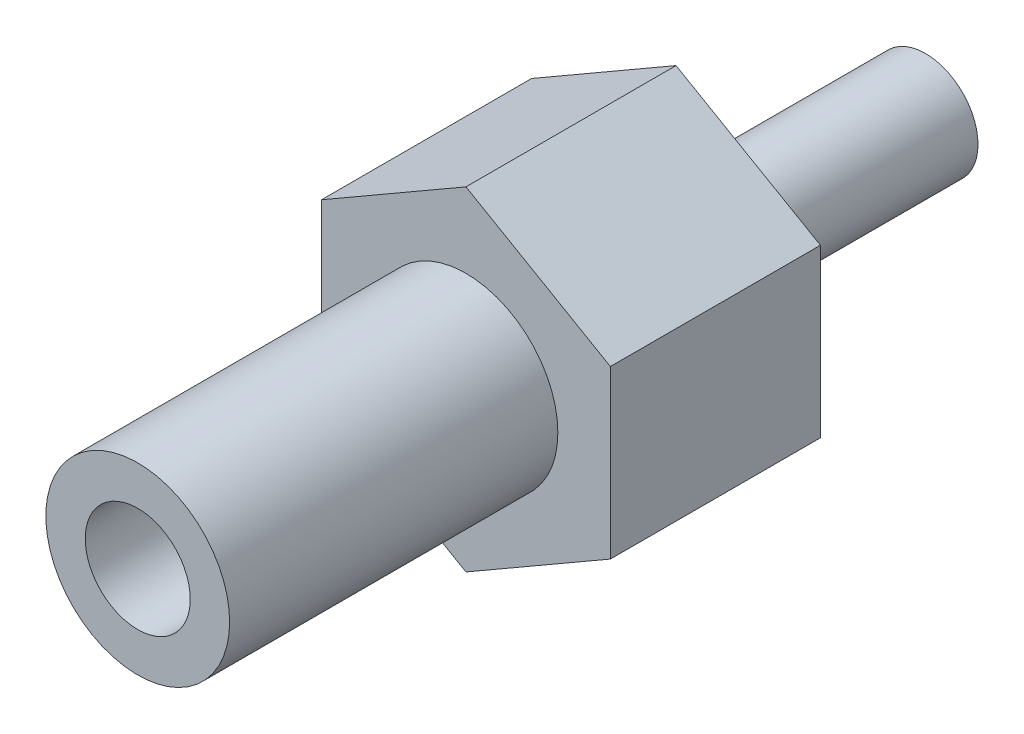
ISO-10303-21;
HEADER;
FILE_DESCRIPTION(('STEP AP214'),'2;1');
FILE_NAME('part.step','',(''),(''),'','','');
FILE_SCHEMA(('AUTOMOTIVE_DESIGN { 1 0 10303 214 1 1 1 1 }'));
ENDSEC;
DATA;
#1=APPLICATION_CONTEXT('core data for automotive mechanical design processes');
#2=APPLICATION_PROTOCOL_DEFINITION('international standard','automotive_design',2000,#1);
#3=PRODUCT_CONTEXT('',#1,'mechanical');
#4=PRODUCT('Part','Part','',(#3));
#5=PRODUCT_RELATED_PRODUCT_CATEGORY('part','',(#4));
#6=PRODUCT_DEFINITION_FORMATION('','',#4);
#7=PRODUCT_DEFINITION_CONTEXT('part definition',#1,'design');
#8=PRODUCT_DEFINITION('design','',#6,#7);
#9=PRODUCT_DEFINITION_SHAPE('','',#8);
#10=(LENGTH_UNIT() NAMED_UNIT(*) SI_UNIT(.MILLI.,.METRE.));
#11=(NAMED_UNIT(*) PLANE_ANGLE_UNIT() SI_UNIT($,.RADIAN.));
#12=(NAMED_UNIT(*) SI_UNIT($,.STERADIAN.) SOLID_ANGLE_UNIT());
#13=UNCERTAINTY_MEASURE_WITH_UNIT(LENGTH_MEASURE(1.E-05),#10,'distance_accuracy_value','');
#14=(GEOMETRIC_REPRESENTATION_CONTEXT(3) GLOBAL_UNCERTAINTY_ASSIGNED_CONTEXT((#13)) GLOBAL_UNIT_ASSIGNED_CONTEXT((#10,
#11,#12)) REPRESENTATION_CONTEXT('',''));
#15=CARTESIAN_POINT('',(0.,0.,0.));
#16=DIRECTION('',(0.,0.,1.));
#17=DIRECTION('',(1.,0.,0.));
#18=AXIS2_PLACEMENT_3D('',#15,#16,#17);
#19=CARTESIAN_POINT('',(4.,0.,17.));
#20=DIRECTION('',(0.,0.,-1.));
#21=DIRECTION('',(-1.,0.,0.));
#22=AXIS2_PLACEMENT_3D('',#19,#20,#21);
#23=PLANE('',#22);
#24=CARTESIAN_POINT('',(0.,0.,17.));
#25=DIRECTION('',(0.,0.,1.));
#26=DIRECTION('',(1.,0.,0.));
#27=AXIS2_PLACEMENT_3D('',#24,#25,#26);
#28=CIRCLE('',#27,4.);
#29=CARTESIAN_POINT('',(4.,0.,17.));
#30=VERTEX_POINT('',#29);
#31=EDGE_CURVE('E126',#30,#30,#28,.T.);
#32=ORIENTED_EDGE('',*,*,#31,.T.);
#33=EDGE_LOOP('',(#32));
#34=FACE_BOUND('',#33,.T.);
#35=ADVANCED_FACE('F14',(#34),#23,.F.);
#36=CARTESIAN_POINT('',(0.,0.,50.));
#37=DIRECTION('',(0.,0.,1.));
#38=DIRECTION('',(1.,0.,0.));
#39=AXIS2_PLACEMENT_3D('',#36,#37,#38);
#40=CYLINDRICAL_SURFACE('',#39,4.);
#41=ORIENTED_EDGE('',*,*,#31,.F.);
#42=EDGE_LOOP('',(#41));
#43=FACE_BOUND('',#42,.T.);
#44=CARTESIAN_POINT('',(0.,0.,41.));
#45=DIRECTION('',(0.,0.,1.));
#46=DIRECTION('',(1.,0.,0.));
#47=AXIS2_PLACEMENT_3D('',#44,#45,#46);
#48=CIRCLE('',#47,4.);
#49=CARTESIAN_POINT('',(4.,0.,41.));
#50=VERTEX_POINT('',#49);
#51=EDGE_CURVE('E123',#50,#50,#48,.T.);
#52=ORIENTED_EDGE('',*,*,#51,.T.);
#53=EDGE_LOOP('',(#52));
#54=FACE_BOUND('',#53,.T.);
#55=ADVANCED_FACE('F149',(#43,#54),#40,.F.);
#56=CARTESIAN_POINT('',(7.,0.,41.));
#57=DIRECTION('',(0.,0.,-1.));
#58=DIRECTION('',(-1.,0.,0.));
#59=AXIS2_PLACEMENT_3D('',#56,#57,#58);
#60=PLANE('',#59);
#61=ORIENTED_EDGE('',*,*,#51,.F.);
#62=EDGE_LOOP('',(#61));
#63=FACE_BOUND('',#62,.T.);
#64=CARTESIAN_POINT('',(0.,0.,41.));
#65=DIRECTION('',(0.,0.,1.));
#66=DIRECTION('',(1.,0.,0.));
#67=AXIS2_PLACEMENT_3D('',#64,#65,#66);
#68=CIRCLE('',#67,7.);
#69=CARTESIAN_POINT('',(7.,0.,41.));
#70=VERTEX_POINT('',#69);
#71=EDGE_CURVE('E120',#70,#70,#68,.T.);
#72=ORIENTED_EDGE('',*,*,#71,.T.);
#73=EDGE_LOOP('',(#72));
#74=FACE_BOUND('',#73,.T.);
#75=ADVANCED_FACE('F155',(#63,#74),#60,.F.);
#76=CARTESIAN_POINT('',(0.,0.,50.));
#77=DIRECTION('',(0.,0.,1.));
#78=DIRECTION('',(1.,0.,0.));
#79=AXIS2_PLACEMENT_3D('',#76,#77,#78);
#80=CYLINDRICAL_SURFACE('',#79,7.);
#81=ORIENTED_EDGE('',*,*,#71,.F.);
#82=EDGE_LOOP('',(#81));
#83=FACE_BOUND('',#82,.T.);
#84=CARTESIAN_POINT('',(0.,0.,16.));
#85=DIRECTION('',(0.,0.,1.));
#86=DIRECTION('',(1.,0.,0.));
#87=AXIS2_PLACEMENT_3D('',#84,#85,#86);
#88=CIRCLE('',#87,7.);
#89=CARTESIAN_POINT('',(7.,0.,16.));
#90=VERTEX_POINT('',#89);
#91=EDGE_CURVE('E75',#90,#90,#88,.T.);
#92=ORIENTED_EDGE('',*,*,#91,.T.);
#93=EDGE_LOOP('',(#92));
#94=FACE_BOUND('',#93,.T.);
#95=ADVANCED_FACE('F161',(#83,#94),#80,.T.);
#96=CARTESIAN_POINT('',(15.,0.,16.));
#97=DIRECTION('',(0.,0.,-1.));
#98=DIRECTION('',(-1.,0.,0.));
#99=AXIS2_PLACEMENT_3D('',#96,#97,#98);
#100=PLANE('',#99);
#101=DIRECTION('',(-0.866025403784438,0.5,0.));
#102=VECTOR('',#101,1.);
#103=CARTESIAN_POINT('',(0.,-12.7017059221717,16.));
#104=LINE('',#103,#102);
#105=CARTESIAN_POINT('',(0.,-12.7017059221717,16.));
#106=VERTEX_POINT('',#105);
#107=CARTESIAN_POINT('',(-11.,-6.35085296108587,16.));
#108=VERTEX_POINT('',#107);
#109=EDGE_CURVE('E95',#106,#108,#104,.T.);
#110=ORIENTED_EDGE('',*,*,#109,.F.);
#111=DIRECTION('',(0.866025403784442,0.5,0.));
#112=VECTOR('',#111,1.);
#113=CARTESIAN_POINT('',(0.,-12.7017059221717,16.));
#114=LINE('',#113,#112);
#115=CARTESIAN_POINT('',(11.,-6.35085296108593,16.));
#116=VERTEX_POINT('',#115);
#117=EDGE_CURVE('E37',#106,#116,#114,.T.);
#118=ORIENTED_EDGE('',*,*,#117,.T.);
#119=DIRECTION('',(0.,-1.,0.));
#120=VECTOR('',#119,1.);
#121=CARTESIAN_POINT('',(11.,6.35085296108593,16.));
#122=LINE('',#121,#120);
#123=CARTESIAN_POINT('',(11.,6.35085296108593,16.));
#124=VERTEX_POINT('',#123);
#125=EDGE_CURVE('E74',#124,#116,#122,.T.);
#126=ORIENTED_EDGE('',*,*,#125,.F.);
#127=DIRECTION('',(0.866025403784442,-0.5,0.));
#128=VECTOR('',#127,1.);
#129=CARTESIAN_POINT('',(0.,12.7017059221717,16.));
#130=LINE('',#129,#128);
#131=CARTESIAN_POINT('',(0.,12.7017059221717,16.));
#132=VERTEX_POINT('',#131);
#133=EDGE_CURVE('E104',#132,#124,#130,.T.);
#134=ORIENTED_EDGE('',*,*,#133,.F.);
#135=DIRECTION('',(-0.866025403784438,-0.5,0.));
#136=VECTOR('',#135,1.);
#137=CARTESIAN_POINT('',(0.,12.7017059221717,16.));
#138=LINE('',#137,#136);
#139=CARTESIAN_POINT('',(-11.,6.35085296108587,16.));
#140=VERTEX_POINT('',#139);
#141=EDGE_CURVE('E101',#132,#140,#138,.T.);
#142=ORIENTED_EDGE('',*,*,#141,.T.);
#143=DIRECTION('',(0.,-1.,0.));
#144=VECTOR('',#143,1.);
#145=CARTESIAN_POINT('',(-11.,6.35085296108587,16.));
#146=LINE('',#145,#144);
#147=EDGE_CURVE('E98',#140,#108,#146,.T.);
#148=ORIENTED_EDGE('',*,*,#147,.T.);
#149=EDGE_LOOP('',(#110,#118,#126,#134,#142,#148));
#150=FACE_BOUND('',#149,.T.);
#151=ORIENTED_EDGE('',*,*,#91,.F.);
#152=EDGE_LOOP('',(#151));
#153=FACE_BOUND('',#152,.T.);
#154=ADVANCED_FACE('F165',(#150,#153),#100,.F.);
#155=CARTESIAN_POINT('',(0.,-12.7017059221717,16.));
#156=DIRECTION('',(-0.5,0.866025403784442,0.));
#157=DIRECTION('',(-0.866025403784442,-0.5,0.));
#158=AXIS2_PLACEMENT_3D('',#155,#156,#157);
#159=PLANE('',#158);
#160=DIRECTION('',(0.,0.,-1.));
#161=VECTOR('',#160,1.);
#162=CARTESIAN_POINT('',(11.,-6.35085296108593,16.));
#163=LINE('',#162,#161);
#164=CARTESIAN_POINT('',(11.,-6.35085296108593,0.));
#165=VERTEX_POINT('',#164);
#166=EDGE_CURVE('E67',#116,#165,#163,.T.);
#167=ORIENTED_EDGE('',*,*,#166,.F.);
#168=ORIENTED_EDGE('',*,*,#117,.F.);
#169=DIRECTION('',(0.,0.,-1.));
#170=VECTOR('',#169,1.);
#171=CARTESIAN_POINT('',(0.,-12.7017059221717,16.));
#172=LINE('',#171,#170);
#173=CARTESIAN_POINT('',(0.,-12.7017059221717,0.));
#174=VERTEX_POINT('',#173);
#175=EDGE_CURVE('E81',#106,#174,#172,.T.);
#176=ORIENTED_EDGE('',*,*,#175,.T.);
#177=DIRECTION('',(0.866025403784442,0.5,0.));
#178=VECTOR('',#177,1.);
#179=CARTESIAN_POINT('',(0.,-12.7017059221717,0.));
#180=LINE('',#179,#178);
#181=EDGE_CURVE('E79',#174,#165,#180,.T.);
#182=ORIENTED_EDGE('',*,*,#181,.T.);
#183=EDGE_LOOP('',(#167,#168,#176,#182));
#184=FACE_BOUND('',#183,.T.);
#185=ADVANCED_FACE('F80',(#184),#159,.F.);
#186=CARTESIAN_POINT('',(11.,6.35085296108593,16.));
#187=DIRECTION('',(1.,0.,0.));
#188=DIRECTION('',(0.,0.,-1.));
#189=AXIS2_PLACEMENT_3D('',#186,#187,#188);
#190=PLANE('',#189);
#191=DIRECTION('',(0.,0.,-1.));
#192=VECTOR('',#191,1.);
#193=CARTESIAN_POINT('',(11.,6.35085296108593,16.));
#194=LINE('',#193,#192);
#195=CARTESIAN_POINT('',(11.,6.35085296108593,0.));
#196=VERTEX_POINT('',#195);
#197=EDGE_CURVE('E76',#124,#196,#194,.T.);
#198=ORIENTED_EDGE('',*,*,#197,.F.);
#199=ORIENTED_EDGE('',*,*,#125,.T.);
#200=ORIENTED_EDGE('',*,*,#166,.T.);
#201=DIRECTION('',(0.,-1.,0.));
#202=VECTOR('',#201,1.);
#203=CARTESIAN_POINT('',(11.,6.35085296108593,0.));
#204=LINE('',#203,#202);
#205=EDGE_CURVE('E71',#196,#165,#204,.T.);
#206=ORIENTED_EDGE('',*,*,#205,.F.);
#207=EDGE_LOOP('',(#198,#199,#200,#206));
#208=FACE_BOUND('',#207,.T.);
#209=ADVANCED_FACE('F69',(#208),#190,.T.);
#210=CARTESIAN_POINT('',(0.,12.7017059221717,16.));
#211=DIRECTION('',(0.5,0.866025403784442,0.));
#212=DIRECTION('',(-0.866025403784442,0.5,0.));
#213=AXIS2_PLACEMENT_3D('',#210,#211,#212);
#214=PLANE('',#213);
#215=DIRECTION('',(0.,0.,-1.));
#216=VECTOR('',#215,1.);
#217=CARTESIAN_POINT('',(0.,12.7017059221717,16.));
#218=LINE('',#217,#216);
#219=CARTESIAN_POINT('',(0.,12.7017059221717,0.));
#220=VERTEX_POINT('',#219);
#221=EDGE_CURVE('E115',#132,#220,#218,.T.);
#222=ORIENTED_EDGE('',*,*,#221,.F.);
#223=ORIENTED_EDGE('',*,*,#133,.T.);
#224=ORIENTED_EDGE('',*,*,#197,.T.);
#225=DIRECTION('',(0.866025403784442,-0.5,0.));
#226=VECTOR('',#225,1.);
#227=CARTESIAN_POINT('',(0.,12.7017059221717,0.));
#228=LINE('',#227,#226);
#229=EDGE_CURVE('E89',#220,#196,#228,.T.);
#230=ORIENTED_EDGE('',*,*,#229,.F.);
#231=EDGE_LOOP('',(#222,#223,#224,#230));
#232=FACE_BOUND('',#231,.T.);
#233=ADVANCED_FACE('F172',(#232),#214,.T.);
#234=CARTESIAN_POINT('',(0.,12.7017059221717,16.));
#235=DIRECTION('',(0.5,-0.866025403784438,0.));
#236=DIRECTION('',(0.866025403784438,0.5,0.));
#237=AXIS2_PLACEMENT_3D('',#234,#235,#236);
#238=PLANE('',#237);
#239=DIRECTION('',(0.,0.,-1.));
#240=VECTOR('',#239,1.);
#241=CARTESIAN_POINT('',(-11.,6.35085296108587,16.));
#242=LINE('',#241,#240);
#243=CARTESIAN_POINT('',(-11.,6.35085296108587,0.));
#244=VERTEX_POINT('',#243);
#245=EDGE_CURVE('E113',#140,#244,#242,.T.);
#246=ORIENTED_EDGE('',*,*,#245,.F.);
#247=ORIENTED_EDGE('',*,*,#141,.F.);
#248=ORIENTED_EDGE('',*,*,#221,.T.);
#249=DIRECTION('',(-0.866025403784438,-0.5,0.));
#250=VECTOR('',#249,1.);
#251=CARTESIAN_POINT('',(0.,12.7017059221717,0.));
#252=LINE('',#251,#250);
#253=EDGE_CURVE('E91',#220,#244,#252,.T.);
#254=ORIENTED_EDGE('',*,*,#253,.T.);
#255=EDGE_LOOP('',(#246,#247,#248,#254));
#256=FACE_BOUND('',#255,.T.);
#257=ADVANCED_FACE('F175',(#256),#238,.F.);
#258=CARTESIAN_POINT('',(-11.,6.35085296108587,16.));
#259=DIRECTION('',(1.,0.,0.));
#260=DIRECTION('',(0.,0.,-1.));
#261=AXIS2_PLACEMENT_3D('',#258,#259,#260);
#262=PLANE('',#261);
#263=DIRECTION('',(0.,0.,-1.));
#264=VECTOR('',#263,1.);
#265=CARTESIAN_POINT('',(-11.,-6.35085296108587,16.));
#266=LINE('',#265,#264);
#267=CARTESIAN_POINT('',(-11.,-6.35085296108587,0.));
#268=VERTEX_POINT('',#267);
#269=EDGE_CURVE('E111',#108,#268,#266,.T.);
#270=ORIENTED_EDGE('',*,*,#269,.F.);
#271=ORIENTED_EDGE('',*,*,#147,.F.);
#272=ORIENTED_EDGE('',*,*,#245,.T.);
#273=DIRECTION('',(0.,-1.,0.));
#274=VECTOR('',#273,1.);
#275=CARTESIAN_POINT('',(-11.,6.35085296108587,0.));
#276=LINE('',#275,#274);
#277=EDGE_CURVE('E29',#244,#268,#276,.T.);
#278=ORIENTED_EDGE('',*,*,#277,.T.);
#279=EDGE_LOOP('',(#270,#271,#272,#278));
#280=FACE_BOUND('',#279,.T.);
#281=ADVANCED_FACE('F144',(#280),#262,.F.);
#282=CARTESIAN_POINT('',(0.,-12.7017059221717,16.));
#283=DIRECTION('',(-0.5,-0.866025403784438,0.));
#284=DIRECTION('',(0.866025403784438,-0.5,0.));
#285=AXIS2_PLACEMENT_3D('',#282,#283,#284);
#286=PLANE('',#285);
#287=ORIENTED_EDGE('',*,*,#109,.T.);
#288=ORIENTED_EDGE('',*,*,#269,.T.);
#289=DIRECTION('',(-0.866025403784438,0.5,0.));
#290=VECTOR('',#289,1.);
#291=CARTESIAN_POINT('',(0.,-12.7017059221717,0.));
#292=LINE('',#291,#290);
#293=EDGE_CURVE('E109',#174,#268,#292,.T.);
#294=ORIENTED_EDGE('',*,*,#293,.F.);
#295=ORIENTED_EDGE('',*,*,#175,.F.);
#296=EDGE_LOOP('',(#287,#288,#294,#295));
#297=FACE_BOUND('',#296,.T.);
#298=ADVANCED_FACE('F135',(#297),#286,.T.);
#299=CARTESIAN_POINT('',(0.,0.,-19.));
#300=DIRECTION('',(0.,0.,1.));
#301=DIRECTION('',(1.,0.,0.));
#302=AXIS2_PLACEMENT_3D('',#299,#300,#301);
#303=PLANE('',#302);
#304=CARTESIAN_POINT('',(0.,0.,-19.));
#305=DIRECTION('',(0.,0.,1.));
#306=DIRECTION('',(1.,0.,0.));
#307=AXIS2_PLACEMENT_3D('',#304,#305,#306);
#308=CIRCLE('',#307,4.);
#309=CARTESIAN_POINT('',(4.,0.,-19.));
#310=VERTEX_POINT('',#309);
#311=EDGE_CURVE('E22',#310,#310,#308,.T.);
#312=ORIENTED_EDGE('',*,*,#311,.F.);
#313=EDGE_LOOP('',(#312));
#314=FACE_BOUND('',#313,.T.);
#315=ADVANCED_FACE('F133',(#314),#303,.F.);
#316=CARTESIAN_POINT('',(0.,0.,50.));
#317=DIRECTION('',(0.,0.,1.));
#318=DIRECTION('',(1.,0.,0.));
#319=AXIS2_PLACEMENT_3D('',#316,#317,#318);
#320=CYLINDRICAL_SURFACE('',#319,4.);
#321=CARTESIAN_POINT('',(0.,0.,0.));
#322=DIRECTION('',(0.,0.,1.));
#323=DIRECTION('',(1.,0.,0.));
#324=AXIS2_PLACEMENT_3D('',#321,#322,#323);
#325=CIRCLE('',#324,4.);
#326=CARTESIAN_POINT('',(4.,0.,0.));
#327=VERTEX_POINT('',#326);
#328=EDGE_CURVE('E9',#327,#327,#325,.T.);
#329=ORIENTED_EDGE('',*,*,#328,.F.);
#330=EDGE_LOOP('',(#329));
#331=FACE_BOUND('',#330,.T.);
#332=ORIENTED_EDGE('',*,*,#311,.T.);
#333=EDGE_LOOP('',(#332));
#334=FACE_BOUND('',#333,.T.);
#335=ADVANCED_FACE('F131',(#331,#334),#320,.T.);
#336=CARTESIAN_POINT('',(4.,0.,0.));
#337=DIRECTION('',(0.,0.,1.));
#338=DIRECTION('',(1.,0.,0.));
#339=AXIS2_PLACEMENT_3D('',#336,#337,#338);
#340=PLANE('',#339);
#341=ORIENTED_EDGE('',*,*,#205,.T.);
#342=ORIENTED_EDGE('',*,*,#181,.F.);
#343=ORIENTED_EDGE('',*,*,#293,.T.);
#344=ORIENTED_EDGE('',*,*,#277,.F.);
#345=ORIENTED_EDGE('',*,*,#253,.F.);
#346=ORIENTED_EDGE('',*,*,#229,.T.);
#347=EDGE_LOOP('',(#341,#342,#343,#344,#345,#346));
#348=FACE_BOUND('',#347,.T.);
#349=ORIENTED_EDGE('',*,*,#328,.T.);
#350=EDGE_LOOP('',(#349));
#351=FACE_BOUND('',#350,.T.);
#352=ADVANCED_FACE('F16',(#348,#351),#340,.F.);
#353=CLOSED_SHELL('',(#35,#55,#75,#95,#154,#185,#209,#233,#257,#281,#298,#315,#335,#352));
#354=MANIFOLD_SOLID_BREP('B1',#353);
#355=ADVANCED_BREP_SHAPE_REPRESENTATION('',(#18,#354),#14);
#356=SHAPE_DEFINITION_REPRESENTATION(#9,#355);
ENDSEC;
END-ISO-10303-21;
